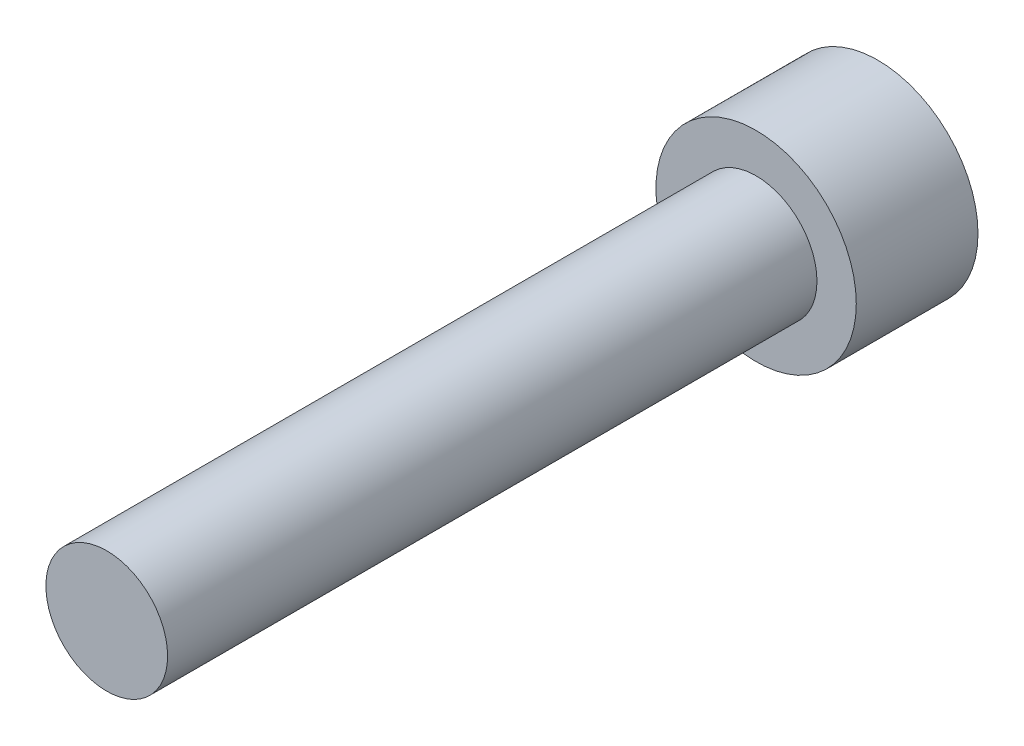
ISO-10303-21;
HEADER;
FILE_DESCRIPTION(('STEP AP214'),'2;1');
FILE_NAME('part.step','',(''),(''),'','','');
FILE_SCHEMA(('AUTOMOTIVE_DESIGN { 1 0 10303 214 1 1 1 1 }'));
ENDSEC;
DATA;
#1=APPLICATION_CONTEXT('core data for automotive mechanical design processes');
#2=APPLICATION_PROTOCOL_DEFINITION('international standard','automotive_design',2000,#1);
#3=PRODUCT_CONTEXT('',#1,'mechanical');
#4=PRODUCT('Part','Part','',(#3));
#5=PRODUCT_RELATED_PRODUCT_CATEGORY('part','',(#4));
#6=PRODUCT_DEFINITION_FORMATION('','',#4);
#7=PRODUCT_DEFINITION_CONTEXT('part definition',#1,'design');
#8=PRODUCT_DEFINITION('design','',#6,#7);
#9=PRODUCT_DEFINITION_SHAPE('','',#8);
#10=(LENGTH_UNIT() NAMED_UNIT(*) SI_UNIT(.MILLI.,.METRE.));
#11=(NAMED_UNIT(*) PLANE_ANGLE_UNIT() SI_UNIT($,.RADIAN.));
#12=(NAMED_UNIT(*) SI_UNIT($,.STERADIAN.) SOLID_ANGLE_UNIT());
#13=UNCERTAINTY_MEASURE_WITH_UNIT(LENGTH_MEASURE(1.E-05),#10,'distance_accuracy_value','');
#14=(GEOMETRIC_REPRESENTATION_CONTEXT(3) GLOBAL_UNCERTAINTY_ASSIGNED_CONTEXT((#13)) GLOBAL_UNIT_ASSIGNED_CONTEXT((#10,
#11,#12)) REPRESENTATION_CONTEXT('',''));
#15=CARTESIAN_POINT('',(0.,0.,0.));
#16=DIRECTION('',(0.,0.,1.));
#17=DIRECTION('',(1.,0.,0.));
#18=AXIS2_PLACEMENT_3D('',#15,#16,#17);
#19=CARTESIAN_POINT('',(0.,0.,22.225));
#20=DIRECTION('',(0.,0.,1.));
#21=DIRECTION('',(1.,0.,0.));
#22=AXIS2_PLACEMENT_3D('',#19,#20,#21);
#23=PLANE('',#22);
#24=CARTESIAN_POINT('',(0.,0.,22.225));
#25=DIRECTION('',(0.,0.,1.));
#26=DIRECTION('',(1.,0.,0.));
#27=AXIS2_PLACEMENT_3D('',#24,#25,#26);
#28=CIRCLE('',#27,2.0828);
#29=CARTESIAN_POINT('',(2.0828,0.,22.225));
#30=VERTEX_POINT('',#29);
#31=EDGE_CURVE('E11',#30,#30,#28,.T.);
#32=ORIENTED_EDGE('',*,*,#31,.T.);
#33=EDGE_LOOP('',(#32));
#34=FACE_BOUND('',#33,.T.);
#35=ADVANCED_FACE('F32',(#34),#23,.T.);
#36=CARTESIAN_POINT('',(0.,0.,22.225));
#37=DIRECTION('',(0.,0.,1.));
#38=DIRECTION('',(1.,0.,0.));
#39=AXIS2_PLACEMENT_3D('',#36,#37,#38);
#40=CYLINDRICAL_SURFACE('',#39,2.0828);
#41=CARTESIAN_POINT('',(0.,0.,0.));
#42=DIRECTION('',(0.,0.,1.));
#43=DIRECTION('',(1.,0.,0.));
#44=AXIS2_PLACEMENT_3D('',#41,#42,#43);
#45=CIRCLE('',#44,2.0828);
#46=CARTESIAN_POINT('',(2.0828,0.,0.));
#47=VERTEX_POINT('',#46);
#48=EDGE_CURVE('E39',#47,#47,#45,.T.);
#49=ORIENTED_EDGE('',*,*,#48,.T.);
#50=EDGE_LOOP('',(#49));
#51=FACE_BOUND('',#50,.T.);
#52=ORIENTED_EDGE('',*,*,#31,.F.);
#53=EDGE_LOOP('',(#52));
#54=FACE_BOUND('',#53,.T.);
#55=ADVANCED_FACE('F146',(#51,#54),#40,.T.);
#56=CARTESIAN_POINT('',(0.,-2.0828,0.));
#57=DIRECTION('',(0.,0.,1.));
#58=DIRECTION('',(1.,0.,0.));
#59=AXIS2_PLACEMENT_3D('',#56,#57,#58);
#60=PLANE('',#59);
#61=CARTESIAN_POINT('',(0.,0.,0.));
#62=DIRECTION('',(0.,0.,1.));
#63=DIRECTION('',(1.,0.,0.));
#64=AXIS2_PLACEMENT_3D('',#61,#62,#63);
#65=CIRCLE('',#64,3.429);
#66=CARTESIAN_POINT('',(3.429,0.,0.));
#67=VERTEX_POINT('',#66);
#68=EDGE_CURVE('E141',#67,#67,#65,.T.);
#69=ORIENTED_EDGE('',*,*,#68,.T.);
#70=EDGE_LOOP('',(#69));
#71=FACE_BOUND('',#70,.T.);
#72=ORIENTED_EDGE('',*,*,#48,.F.);
#73=EDGE_LOOP('',(#72));
#74=FACE_BOUND('',#73,.T.);
#75=ADVANCED_FACE('F149',(#71,#74),#60,.T.);
#76=CARTESIAN_POINT('',(0.,0.,22.225));
#77=DIRECTION('',(0.,0.,1.));
#78=DIRECTION('',(1.,0.,0.));
#79=AXIS2_PLACEMENT_3D('',#76,#77,#78);
#80=CYLINDRICAL_SURFACE('',#79,3.429);
#81=CARTESIAN_POINT('',(0.,0.,-4.1656));
#82=DIRECTION('',(0.,0.,1.));
#83=DIRECTION('',(1.,0.,0.));
#84=AXIS2_PLACEMENT_3D('',#81,#82,#83);
#85=CIRCLE('',#84,3.429);
#86=CARTESIAN_POINT('',(3.429,0.,-4.1656));
#87=VERTEX_POINT('',#86);
#88=EDGE_CURVE('E133',#87,#87,#85,.T.);
#89=ORIENTED_EDGE('',*,*,#88,.T.);
#90=EDGE_LOOP('',(#89));
#91=FACE_BOUND('',#90,.T.);
#92=ORIENTED_EDGE('',*,*,#68,.F.);
#93=EDGE_LOOP('',(#92));
#94=FACE_BOUND('',#93,.T.);
#95=ADVANCED_FACE('F151',(#91,#94),#80,.T.);
#96=CARTESIAN_POINT('',(0.,-3.429,-4.1656));
#97=DIRECTION('',(0.,0.,-1.));
#98=DIRECTION('',(-1.,0.,0.));
#99=AXIS2_PLACEMENT_3D('',#96,#97,#98);
#100=PLANE('',#99);
#101=DIRECTION('',(0.866025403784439,-0.5,0.));
#102=VECTOR('',#101,1.);
#103=CARTESIAN_POINT('',(0.,2.05305755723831,-4.1656));
#104=LINE('',#103,#102);
#105=CARTESIAN_POINT('',(0.,2.05305755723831,-4.1656));
#106=VERTEX_POINT('',#105);
#107=CARTESIAN_POINT('',(1.778,1.02652877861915,-4.1656));
#108=VERTEX_POINT('',#107);
#109=EDGE_CURVE('E46',#106,#108,#104,.T.);
#110=ORIENTED_EDGE('',*,*,#109,.F.);
#111=DIRECTION('',(0.866025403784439,0.5,0.));
#112=VECTOR('',#111,1.);
#113=CARTESIAN_POINT('',(-1.778,1.02652877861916,-4.1656));
#114=LINE('',#113,#112);
#115=CARTESIAN_POINT('',(-1.778,1.02652877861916,-4.1656));
#116=VERTEX_POINT('',#115);
#117=EDGE_CURVE('E129',#116,#106,#114,.T.);
#118=ORIENTED_EDGE('',*,*,#117,.F.);
#119=DIRECTION('',(0.,1.,0.));
#120=VECTOR('',#119,1.);
#121=CARTESIAN_POINT('',(-1.778,-1.02652877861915,-4.1656));
#122=LINE('',#121,#120);
#123=CARTESIAN_POINT('',(-1.778,-1.02652877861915,-4.1656));
#124=VERTEX_POINT('',#123);
#125=EDGE_CURVE('E127',#124,#116,#122,.T.);
#126=ORIENTED_EDGE('',*,*,#125,.F.);
#127=DIRECTION('',(-0.866025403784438,0.5,0.));
#128=VECTOR('',#127,1.);
#129=CARTESIAN_POINT('',(0.,-2.05305755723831,-4.1656));
#130=LINE('',#129,#128);
#131=CARTESIAN_POINT('',(0.,-2.05305755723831,-4.1656));
#132=VERTEX_POINT('',#131);
#133=EDGE_CURVE('E94',#132,#124,#130,.T.);
#134=ORIENTED_EDGE('',*,*,#133,.F.);
#135=DIRECTION('',(-0.866025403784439,-0.5,0.));
#136=VECTOR('',#135,1.);
#137=CARTESIAN_POINT('',(1.778,-1.02652877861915,-4.1656));
#138=LINE('',#137,#136);
#139=CARTESIAN_POINT('',(1.778,-1.02652877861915,-4.1656));
#140=VERTEX_POINT('',#139);
#141=EDGE_CURVE('E123',#140,#132,#138,.T.);
#142=ORIENTED_EDGE('',*,*,#141,.F.);
#143=DIRECTION('',(0.,-1.,0.));
#144=VECTOR('',#143,1.);
#145=CARTESIAN_POINT('',(1.778,1.02652877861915,-4.1656));
#146=LINE('',#145,#144);
#147=EDGE_CURVE('E120',#108,#140,#146,.T.);
#148=ORIENTED_EDGE('',*,*,#147,.F.);
#149=EDGE_LOOP('',(#110,#118,#126,#134,#142,#148));
#150=FACE_BOUND('',#149,.T.);
#151=ORIENTED_EDGE('',*,*,#88,.F.);
#152=EDGE_LOOP('',(#151));
#153=FACE_BOUND('',#152,.T.);
#154=ADVANCED_FACE('F158',(#150,#153),#100,.T.);
#155=CARTESIAN_POINT('',(0.,2.05305755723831,-1.3716));
#156=DIRECTION('',(0.5,0.866025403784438,0.));
#157=DIRECTION('',(-0.866025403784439,0.5,0.));
#158=AXIS2_PLACEMENT_3D('',#155,#156,#157);
#159=PLANE('',#158);
#160=ORIENTED_EDGE('',*,*,#109,.T.);
#161=DIRECTION('',(0.,0.,-1.));
#162=VECTOR('',#161,1.);
#163=CARTESIAN_POINT('',(1.778,1.02652877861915,-1.3716));
#164=LINE('',#163,#162);
#165=CARTESIAN_POINT('',(1.778,1.02652877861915,-1.3716));
#166=VERTEX_POINT('',#165);
#167=EDGE_CURVE('E76',#166,#108,#164,.T.);
#168=ORIENTED_EDGE('',*,*,#167,.F.);
#169=DIRECTION('',(0.866025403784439,-0.5,0.));
#170=VECTOR('',#169,1.);
#171=CARTESIAN_POINT('',(0.,2.05305755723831,-1.3716));
#172=LINE('',#171,#170);
#173=CARTESIAN_POINT('',(0.,2.05305755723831,-1.3716));
#174=VERTEX_POINT('',#173);
#175=EDGE_CURVE('E131',#174,#166,#172,.T.);
#176=ORIENTED_EDGE('',*,*,#175,.F.);
#177=DIRECTION('',(0.,0.,-1.));
#178=VECTOR('',#177,1.);
#179=CARTESIAN_POINT('',(0.,2.05305755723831,-1.3716));
#180=LINE('',#179,#178);
#181=EDGE_CURVE('E54',#174,#106,#180,.T.);
#182=ORIENTED_EDGE('',*,*,#181,.T.);
#183=EDGE_LOOP('',(#160,#168,#176,#182));
#184=FACE_BOUND('',#183,.T.);
#185=ADVANCED_FACE('F189',(#184),#159,.F.);
#186=CARTESIAN_POINT('',(-1.778,1.02652877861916,-1.3716));
#187=DIRECTION('',(-0.5,0.866025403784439,0.));
#188=DIRECTION('',(-0.866025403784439,-0.5,0.));
#189=AXIS2_PLACEMENT_3D('',#186,#187,#188);
#190=PLANE('',#189);
#191=ORIENTED_EDGE('',*,*,#117,.T.);
#192=ORIENTED_EDGE('',*,*,#181,.F.);
#193=DIRECTION('',(0.866025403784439,0.5,0.));
#194=VECTOR('',#193,1.);
#195=CARTESIAN_POINT('',(-1.778,1.02652877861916,-1.3716));
#196=LINE('',#195,#194);
#197=CARTESIAN_POINT('',(-1.778,1.02652877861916,-1.3716));
#198=VERTEX_POINT('',#197);
#199=EDGE_CURVE('E106',#198,#174,#196,.T.);
#200=ORIENTED_EDGE('',*,*,#199,.F.);
#201=DIRECTION('',(0.,0.,-1.));
#202=VECTOR('',#201,1.);
#203=CARTESIAN_POINT('',(-1.778,1.02652877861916,-1.3716));
#204=LINE('',#203,#202);
#205=EDGE_CURVE('E98',#198,#116,#204,.T.);
#206=ORIENTED_EDGE('',*,*,#205,.T.);
#207=EDGE_LOOP('',(#191,#192,#200,#206));
#208=FACE_BOUND('',#207,.T.);
#209=ADVANCED_FACE('F199',(#208),#190,.F.);
#210=CARTESIAN_POINT('',(-1.778,-1.02652877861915,-1.3716));
#211=DIRECTION('',(-1.,0.,0.));
#212=DIRECTION('',(0.,0.,1.));
#213=AXIS2_PLACEMENT_3D('',#210,#211,#212);
#214=PLANE('',#213);
#215=ORIENTED_EDGE('',*,*,#125,.T.);
#216=ORIENTED_EDGE('',*,*,#205,.F.);
#217=DIRECTION('',(0.,1.,0.));
#218=VECTOR('',#217,1.);
#219=CARTESIAN_POINT('',(-1.778,-1.02652877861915,-1.3716));
#220=LINE('',#219,#218);
#221=CARTESIAN_POINT('',(-1.778,-1.02652877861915,-1.3716));
#222=VERTEX_POINT('',#221);
#223=EDGE_CURVE('E102',#222,#198,#220,.T.);
#224=ORIENTED_EDGE('',*,*,#223,.F.);
#225=DIRECTION('',(0.,0.,-1.));
#226=VECTOR('',#225,1.);
#227=CARTESIAN_POINT('',(-1.778,-1.02652877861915,-1.3716));
#228=LINE('',#227,#226);
#229=EDGE_CURVE('E87',#222,#124,#228,.T.);
#230=ORIENTED_EDGE('',*,*,#229,.T.);
#231=EDGE_LOOP('',(#215,#216,#224,#230));
#232=FACE_BOUND('',#231,.T.);
#233=ADVANCED_FACE('F103',(#232),#214,.F.);
#234=CARTESIAN_POINT('',(0.,-2.05305755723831,-1.3716));
#235=DIRECTION('',(-0.5,-0.866025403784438,0.));
#236=DIRECTION('',(0.866025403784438,-0.5,0.));
#237=AXIS2_PLACEMENT_3D('',#234,#235,#236);
#238=PLANE('',#237);
#239=ORIENTED_EDGE('',*,*,#133,.T.);
#240=ORIENTED_EDGE('',*,*,#229,.F.);
#241=DIRECTION('',(-0.866025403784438,0.5,0.));
#242=VECTOR('',#241,1.);
#243=CARTESIAN_POINT('',(0.,-2.05305755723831,-1.3716));
#244=LINE('',#243,#242);
#245=CARTESIAN_POINT('',(0.,-2.05305755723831,-1.3716));
#246=VERTEX_POINT('',#245);
#247=EDGE_CURVE('E91',#246,#222,#244,.T.);
#248=ORIENTED_EDGE('',*,*,#247,.F.);
#249=DIRECTION('',(0.,0.,-1.));
#250=VECTOR('',#249,1.);
#251=CARTESIAN_POINT('',(0.,-2.05305755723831,-1.3716));
#252=LINE('',#251,#250);
#253=EDGE_CURVE('E99',#246,#132,#252,.T.);
#254=ORIENTED_EDGE('',*,*,#253,.T.);
#255=EDGE_LOOP('',(#239,#240,#248,#254));
#256=FACE_BOUND('',#255,.T.);
#257=ADVANCED_FACE('F89',(#256),#238,.F.);
#258=CARTESIAN_POINT('',(1.778,-1.02652877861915,-1.3716));
#259=DIRECTION('',(0.5,-0.866025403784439,0.));
#260=DIRECTION('',(0.866025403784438,0.5,0.));
#261=AXIS2_PLACEMENT_3D('',#258,#259,#260);
#262=PLANE('',#261);
#263=ORIENTED_EDGE('',*,*,#141,.T.);
#264=ORIENTED_EDGE('',*,*,#253,.F.);
#265=DIRECTION('',(-0.866025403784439,-0.5,0.));
#266=VECTOR('',#265,1.);
#267=CARTESIAN_POINT('',(1.778,-1.02652877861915,-1.3716));
#268=LINE('',#267,#266);
#269=CARTESIAN_POINT('',(1.778,-1.02652877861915,-1.3716));
#270=VERTEX_POINT('',#269);
#271=EDGE_CURVE('E112',#270,#246,#268,.T.);
#272=ORIENTED_EDGE('',*,*,#271,.F.);
#273=DIRECTION('',(0.,0.,-1.));
#274=VECTOR('',#273,1.);
#275=CARTESIAN_POINT('',(1.778,-1.02652877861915,-1.3716));
#276=LINE('',#275,#274);
#277=EDGE_CURVE('E136',#270,#140,#276,.T.);
#278=ORIENTED_EDGE('',*,*,#277,.T.);
#279=EDGE_LOOP('',(#263,#264,#272,#278));
#280=FACE_BOUND('',#279,.T.);
#281=ADVANCED_FACE('F224',(#280),#262,.F.);
#282=CARTESIAN_POINT('',(1.778,1.02652877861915,-1.3716));
#283=DIRECTION('',(1.,0.,0.));
#284=DIRECTION('',(0.,0.,-1.));
#285=AXIS2_PLACEMENT_3D('',#282,#283,#284);
#286=PLANE('',#285);
#287=ORIENTED_EDGE('',*,*,#147,.T.);
#288=ORIENTED_EDGE('',*,*,#277,.F.);
#289=DIRECTION('',(0.,-1.,0.));
#290=VECTOR('',#289,1.);
#291=CARTESIAN_POINT('',(1.778,1.02652877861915,-1.3716));
#292=LINE('',#291,#290);
#293=EDGE_CURVE('E114',#166,#270,#292,.T.);
#294=ORIENTED_EDGE('',*,*,#293,.F.);
#295=ORIENTED_EDGE('',*,*,#167,.T.);
#296=EDGE_LOOP('',(#287,#288,#294,#295));
#297=FACE_BOUND('',#296,.T.);
#298=ADVANCED_FACE('F233',(#297),#286,.F.);
#299=CARTESIAN_POINT('',(3.556,0.,-1.3716));
#300=DIRECTION('',(0.,0.,-1.));
#301=DIRECTION('',(-1.,0.,0.));
#302=AXIS2_PLACEMENT_3D('',#299,#300,#301);
#303=PLANE('',#302);
#304=ORIENTED_EDGE('',*,*,#175,.T.);
#305=ORIENTED_EDGE('',*,*,#293,.T.);
#306=ORIENTED_EDGE('',*,*,#271,.T.);
#307=ORIENTED_EDGE('',*,*,#247,.T.);
#308=ORIENTED_EDGE('',*,*,#223,.T.);
#309=ORIENTED_EDGE('',*,*,#199,.T.);
#310=EDGE_LOOP('',(#304,#305,#306,#307,#308,#309));
#311=FACE_BOUND('',#310,.T.);
#312=ADVANCED_FACE('F109',(#311),#303,.T.);
#313=CLOSED_SHELL('',(#35,#55,#75,#95,#154,#185,#209,#233,#257,#281,#298,#312));
#314=MANIFOLD_SOLID_BREP('B2',#313);
#315=ADVANCED_BREP_SHAPE_REPRESENTATION('',(#18,#314),#14);
#316=SHAPE_DEFINITION_REPRESENTATION(#9,#315);
ENDSEC;
END-ISO-10303-21;
